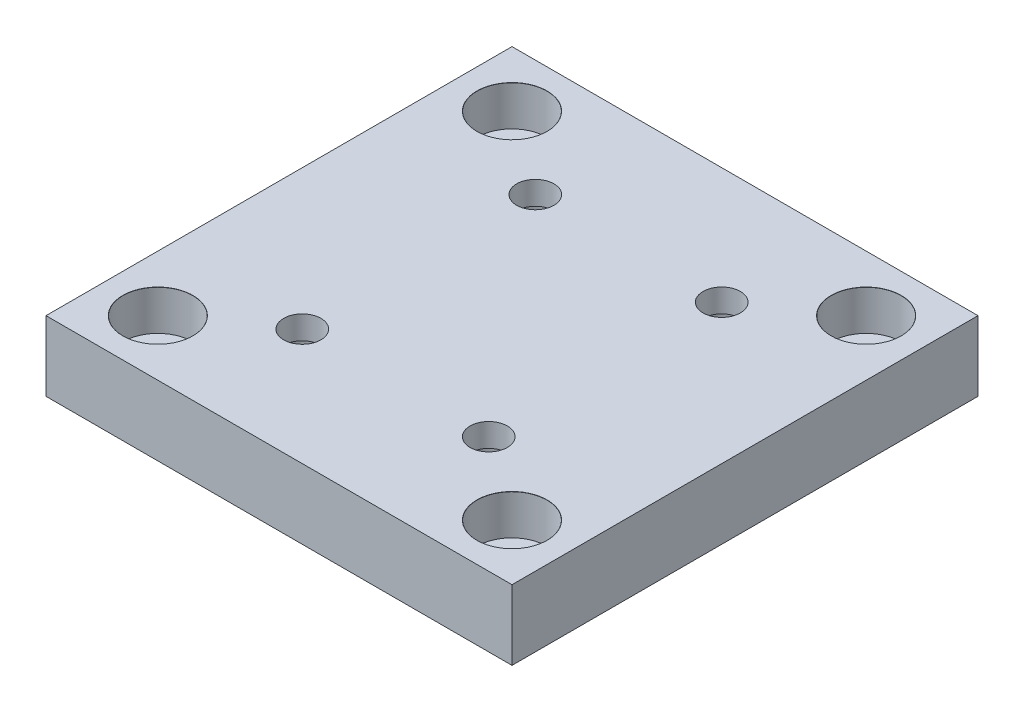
ISO-10303-21;
HEADER;
FILE_DESCRIPTION(('STEP AP214'),'2;1');
FILE_NAME('part.step','',(''),(''),'','','');
FILE_SCHEMA(('AUTOMOTIVE_DESIGN { 1 0 10303 214 1 1 1 1 }'));
ENDSEC;
DATA;
#1=APPLICATION_CONTEXT('core data for automotive mechanical design processes');
#2=APPLICATION_PROTOCOL_DEFINITION('international standard','automotive_design',2000,#1);
#3=PRODUCT_CONTEXT('',#1,'mechanical');
#4=PRODUCT('Part','Part','',(#3));
#5=PRODUCT_RELATED_PRODUCT_CATEGORY('part','',(#4));
#6=PRODUCT_DEFINITION_FORMATION('','',#4);
#7=PRODUCT_DEFINITION_CONTEXT('part definition',#1,'design');
#8=PRODUCT_DEFINITION('design','',#6,#7);
#9=PRODUCT_DEFINITION_SHAPE('','',#8);
#10=(LENGTH_UNIT() NAMED_UNIT(*) SI_UNIT(.MILLI.,.METRE.));
#11=(NAMED_UNIT(*) PLANE_ANGLE_UNIT() SI_UNIT($,.RADIAN.));
#12=(NAMED_UNIT(*) SI_UNIT($,.STERADIAN.) SOLID_ANGLE_UNIT());
#13=UNCERTAINTY_MEASURE_WITH_UNIT(LENGTH_MEASURE(1.E-05),#10,'distance_accuracy_value','');
#14=(GEOMETRIC_REPRESENTATION_CONTEXT(3) GLOBAL_UNCERTAINTY_ASSIGNED_CONTEXT((#13)) GLOBAL_UNIT_ASSIGNED_CONTEXT((#10,
#11,#12)) REPRESENTATION_CONTEXT('',''));
#15=CARTESIAN_POINT('',(0.,0.,0.));
#16=DIRECTION('',(0.,0.,1.));
#17=DIRECTION('',(1.,0.,0.));
#18=AXIS2_PLACEMENT_3D('',#15,#16,#17);
#19=CARTESIAN_POINT('',(20.,15.,25.));
#20=DIRECTION('',(0.,-1.,0.));
#21=DIRECTION('',(0.,0.,-1.));
#22=AXIS2_PLACEMENT_3D('',#19,#20,#21);
#23=CYLINDRICAL_SURFACE('',#22,4.);
#24=CARTESIAN_POINT('',(20.,15.,25.));
#25=DIRECTION('',(0.,-1.,0.));
#26=DIRECTION('',(0.,0.,-1.));
#27=AXIS2_PLACEMENT_3D('',#24,#25,#26);
#28=CIRCLE('',#27,4.);
#29=CARTESIAN_POINT('',(20.,15.,21.));
#30=VERTEX_POINT('',#29);
#31=EDGE_CURVE('E112',#30,#30,#28,.T.);
#32=ORIENTED_EDGE('',*,*,#31,.F.);
#33=EDGE_LOOP('',(#32));
#34=FACE_BOUND('',#33,.T.);
#35=CARTESIAN_POINT('',(20.,10.,25.));
#36=DIRECTION('',(0.,-1.,0.));
#37=DIRECTION('',(0.,0.,-1.));
#38=AXIS2_PLACEMENT_3D('',#35,#36,#37);
#39=CIRCLE('',#38,4.);
#40=CARTESIAN_POINT('',(20.,10.,21.));
#41=VERTEX_POINT('',#40);
#42=EDGE_CURVE('E37',#41,#41,#39,.F.);
#43=ORIENTED_EDGE('',*,*,#42,.F.);
#44=EDGE_LOOP('',(#43));
#45=FACE_BOUND('',#44,.T.);
#46=ADVANCED_FACE('F33',(#34,#45),#23,.F.);
#47=CARTESIAN_POINT('',(20.,15.,-25.));
#48=DIRECTION('',(0.,-1.,0.));
#49=DIRECTION('',(0.,0.,-1.));
#50=AXIS2_PLACEMENT_3D('',#47,#48,#49);
#51=CYLINDRICAL_SURFACE('',#50,4.);
#52=CARTESIAN_POINT('',(20.,15.,-25.));
#53=DIRECTION('',(0.,-1.,0.));
#54=DIRECTION('',(0.,0.,-1.));
#55=AXIS2_PLACEMENT_3D('',#52,#53,#54);
#56=CIRCLE('',#55,4.);
#57=CARTESIAN_POINT('',(20.,15.,-29.));
#58=VERTEX_POINT('',#57);
#59=EDGE_CURVE('E136',#58,#58,#56,.T.);
#60=ORIENTED_EDGE('',*,*,#59,.F.);
#61=EDGE_LOOP('',(#60));
#62=FACE_BOUND('',#61,.T.);
#63=CARTESIAN_POINT('',(20.,10.,-25.));
#64=DIRECTION('',(0.,-1.,0.));
#65=DIRECTION('',(0.,0.,-1.));
#66=AXIS2_PLACEMENT_3D('',#63,#64,#65);
#67=CIRCLE('',#66,4.);
#68=CARTESIAN_POINT('',(20.,10.,-29.));
#69=VERTEX_POINT('',#68);
#70=EDGE_CURVE('E116',#69,#69,#67,.F.);
#71=ORIENTED_EDGE('',*,*,#70,.F.);
#72=EDGE_LOOP('',(#71));
#73=FACE_BOUND('',#72,.T.);
#74=ADVANCED_FACE('F169',(#62,#73),#51,.F.);
#75=CARTESIAN_POINT('',(-20.,15.,-25.));
#76=DIRECTION('',(0.,-1.,0.));
#77=DIRECTION('',(0.,0.,-1.));
#78=AXIS2_PLACEMENT_3D('',#75,#76,#77);
#79=CYLINDRICAL_SURFACE('',#78,4.);
#80=CARTESIAN_POINT('',(-20.,15.,-25.));
#81=DIRECTION('',(0.,-1.,0.));
#82=DIRECTION('',(0.,0.,-1.));
#83=AXIS2_PLACEMENT_3D('',#80,#81,#82);
#84=CIRCLE('',#83,4.);
#85=CARTESIAN_POINT('',(-20.,15.,-29.));
#86=VERTEX_POINT('',#85);
#87=EDGE_CURVE('E133',#86,#86,#84,.T.);
#88=ORIENTED_EDGE('',*,*,#87,.F.);
#89=EDGE_LOOP('',(#88));
#90=FACE_BOUND('',#89,.T.);
#91=CARTESIAN_POINT('',(-20.,10.,-25.));
#92=DIRECTION('',(0.,-1.,0.));
#93=DIRECTION('',(0.,0.,-1.));
#94=AXIS2_PLACEMENT_3D('',#91,#92,#93);
#95=CIRCLE('',#94,4.);
#96=CARTESIAN_POINT('',(-20.,10.,-29.));
#97=VERTEX_POINT('',#96);
#98=EDGE_CURVE('E114',#97,#97,#95,.F.);
#99=ORIENTED_EDGE('',*,*,#98,.F.);
#100=EDGE_LOOP('',(#99));
#101=FACE_BOUND('',#100,.T.);
#102=ADVANCED_FACE('F148',(#90,#101),#79,.F.);
#103=CARTESIAN_POINT('',(-20.,15.,25.));
#104=DIRECTION('',(0.,-1.,0.));
#105=DIRECTION('',(0.,0.,-1.));
#106=AXIS2_PLACEMENT_3D('',#103,#104,#105);
#107=CYLINDRICAL_SURFACE('',#106,4.);
#108=CARTESIAN_POINT('',(-20.,15.,25.));
#109=DIRECTION('',(0.,-1.,0.));
#110=DIRECTION('',(0.,0.,-1.));
#111=AXIS2_PLACEMENT_3D('',#108,#109,#110);
#112=CIRCLE('',#111,4.);
#113=CARTESIAN_POINT('',(-20.,15.,21.));
#114=VERTEX_POINT('',#113);
#115=EDGE_CURVE('E103',#114,#114,#112,.T.);
#116=ORIENTED_EDGE('',*,*,#115,.F.);
#117=EDGE_LOOP('',(#116));
#118=FACE_BOUND('',#117,.T.);
#119=CARTESIAN_POINT('',(-20.,10.,25.));
#120=DIRECTION('',(0.,-1.,0.));
#121=DIRECTION('',(0.,0.,-1.));
#122=AXIS2_PLACEMENT_3D('',#119,#120,#121);
#123=CIRCLE('',#122,4.);
#124=CARTESIAN_POINT('',(-20.,10.,21.));
#125=VERTEX_POINT('',#124);
#126=EDGE_CURVE('E109',#125,#125,#123,.F.);
#127=ORIENTED_EDGE('',*,*,#126,.F.);
#128=EDGE_LOOP('',(#127));
#129=FACE_BOUND('',#128,.T.);
#130=ADVANCED_FACE('F145',(#118,#129),#107,.F.);
#131=CARTESIAN_POINT('',(50.,15.,50.));
#132=DIRECTION('',(-1.,0.,0.));
#133=DIRECTION('',(0.,0.,1.));
#134=AXIS2_PLACEMENT_3D('',#131,#132,#133);
#135=PLANE('',#134);
#136=DIRECTION('',(0.,0.,-1.));
#137=VECTOR('',#136,1.);
#138=CARTESIAN_POINT('',(50.,0.,50.));
#139=LINE('',#138,#137);
#140=CARTESIAN_POINT('',(50.,0.,50.));
#141=VERTEX_POINT('',#140);
#142=CARTESIAN_POINT('',(50.,0.,-50.));
#143=VERTEX_POINT('',#142);
#144=EDGE_CURVE('E100',#141,#143,#139,.T.);
#145=ORIENTED_EDGE('',*,*,#144,.T.);
#146=DIRECTION('',(0.,-1.,0.));
#147=VECTOR('',#146,1.);
#148=CARTESIAN_POINT('',(50.,15.,-50.));
#149=LINE('',#148,#147);
#150=CARTESIAN_POINT('',(50.,15.,-50.));
#151=VERTEX_POINT('',#150);
#152=EDGE_CURVE('E11',#151,#143,#149,.T.);
#153=ORIENTED_EDGE('',*,*,#152,.F.);
#154=DIRECTION('',(0.,0.,-1.));
#155=VECTOR('',#154,1.);
#156=CARTESIAN_POINT('',(50.,15.,50.));
#157=LINE('',#156,#155);
#158=CARTESIAN_POINT('',(50.,15.,50.));
#159=VERTEX_POINT('',#158);
#160=EDGE_CURVE('E87',#159,#151,#157,.T.);
#161=ORIENTED_EDGE('',*,*,#160,.F.);
#162=DIRECTION('',(0.,-1.,0.));
#163=VECTOR('',#162,1.);
#164=CARTESIAN_POINT('',(50.,15.,50.));
#165=LINE('',#164,#163);
#166=EDGE_CURVE('E96',#159,#141,#165,.T.);
#167=ORIENTED_EDGE('',*,*,#166,.T.);
#168=EDGE_LOOP('',(#145,#153,#161,#167));
#169=FACE_BOUND('',#168,.T.);
#170=ADVANCED_FACE('F35',(#169),#135,.F.);
#171=CARTESIAN_POINT('',(-50.,15.,-50.));
#172=DIRECTION('',(0.,0.,1.));
#173=DIRECTION('',(1.,0.,0.));
#174=AXIS2_PLACEMENT_3D('',#171,#172,#173);
#175=PLANE('',#174);
#176=DIRECTION('',(-1.,0.,0.));
#177=VECTOR('',#176,1.);
#178=CARTESIAN_POINT('',(-50.,0.,-50.));
#179=LINE('',#178,#177);
#180=CARTESIAN_POINT('',(-50.,0.,-50.));
#181=VERTEX_POINT('',#180);
#182=EDGE_CURVE('E91',#143,#181,#179,.T.);
#183=ORIENTED_EDGE('',*,*,#182,.T.);
#184=DIRECTION('',(0.,-1.,0.));
#185=VECTOR('',#184,1.);
#186=CARTESIAN_POINT('',(-50.,15.,-50.));
#187=LINE('',#186,#185);
#188=CARTESIAN_POINT('',(-50.,15.,-50.));
#189=VERTEX_POINT('',#188);
#190=EDGE_CURVE('E43',#189,#181,#187,.T.);
#191=ORIENTED_EDGE('',*,*,#190,.F.);
#192=DIRECTION('',(-1.,0.,0.));
#193=VECTOR('',#192,1.);
#194=CARTESIAN_POINT('',(-50.,15.,-50.));
#195=LINE('',#194,#193);
#196=EDGE_CURVE('E82',#151,#189,#195,.T.);
#197=ORIENTED_EDGE('',*,*,#196,.F.);
#198=ORIENTED_EDGE('',*,*,#152,.T.);
#199=EDGE_LOOP('',(#183,#191,#197,#198));
#200=FACE_BOUND('',#199,.T.);
#201=ADVANCED_FACE('F90',(#200),#175,.F.);
#202=CARTESIAN_POINT('',(-50.,15.,50.));
#203=DIRECTION('',(1.,0.,0.));
#204=DIRECTION('',(0.,0.,-1.));
#205=AXIS2_PLACEMENT_3D('',#202,#203,#204);
#206=PLANE('',#205);
#207=DIRECTION('',(0.,0.,1.));
#208=VECTOR('',#207,1.);
#209=CARTESIAN_POINT('',(-50.,0.,50.));
#210=LINE('',#209,#208);
#211=CARTESIAN_POINT('',(-50.,0.,50.));
#212=VERTEX_POINT('',#211);
#213=EDGE_CURVE('E69',#181,#212,#210,.T.);
#214=ORIENTED_EDGE('',*,*,#213,.T.);
#215=DIRECTION('',(0.,-1.,0.));
#216=VECTOR('',#215,1.);
#217=CARTESIAN_POINT('',(-50.,15.,50.));
#218=LINE('',#217,#216);
#219=CARTESIAN_POINT('',(-50.,15.,50.));
#220=VERTEX_POINT('',#219);
#221=EDGE_CURVE('E92',#220,#212,#218,.T.);
#222=ORIENTED_EDGE('',*,*,#221,.F.);
#223=DIRECTION('',(0.,0.,1.));
#224=VECTOR('',#223,1.);
#225=CARTESIAN_POINT('',(-50.,15.,50.));
#226=LINE('',#225,#224);
#227=EDGE_CURVE('E85',#189,#220,#226,.T.);
#228=ORIENTED_EDGE('',*,*,#227,.F.);
#229=ORIENTED_EDGE('',*,*,#190,.T.);
#230=EDGE_LOOP('',(#214,#222,#228,#229));
#231=FACE_BOUND('',#230,.T.);
#232=ADVANCED_FACE('F94',(#231),#206,.F.);
#233=CARTESIAN_POINT('',(-50.,15.,50.));
#234=DIRECTION('',(0.,0.,-1.));
#235=DIRECTION('',(-1.,0.,0.));
#236=AXIS2_PLACEMENT_3D('',#233,#234,#235);
#237=PLANE('',#236);
#238=DIRECTION('',(1.,0.,0.));
#239=VECTOR('',#238,1.);
#240=CARTESIAN_POINT('',(-50.,0.,50.));
#241=LINE('',#240,#239);
#242=EDGE_CURVE('E75',#212,#141,#241,.T.);
#243=ORIENTED_EDGE('',*,*,#242,.T.);
#244=ORIENTED_EDGE('',*,*,#166,.F.);
#245=DIRECTION('',(1.,0.,0.));
#246=VECTOR('',#245,1.);
#247=CARTESIAN_POINT('',(-50.,15.,50.));
#248=LINE('',#247,#246);
#249=EDGE_CURVE('E52',#220,#159,#248,.T.);
#250=ORIENTED_EDGE('',*,*,#249,.F.);
#251=ORIENTED_EDGE('',*,*,#221,.T.);
#252=EDGE_LOOP('',(#243,#244,#250,#251));
#253=FACE_BOUND('',#252,.T.);
#254=ADVANCED_FACE('F182',(#253),#237,.F.);
#255=CARTESIAN_POINT('',(0.,15.,0.));
#256=DIRECTION('',(0.,-1.,0.));
#257=DIRECTION('',(0.,0.,-1.));
#258=AXIS2_PLACEMENT_3D('',#255,#256,#257);
#259=PLANE('',#258);
#260=CARTESIAN_POINT('',(-38.,15.,-38.));
#261=DIRECTION('',(0.,1.,0.));
#262=DIRECTION('',(0.,0.,1.));
#263=AXIS2_PLACEMENT_3D('',#260,#261,#262);
#264=CIRCLE('',#263,7.525);
#265=CARTESIAN_POINT('',(-38.,15.,-30.475));
#266=VERTEX_POINT('',#265);
#267=EDGE_CURVE('E513',#266,#266,#264,.T.);
#268=ORIENTED_EDGE('',*,*,#267,.F.);
#269=EDGE_LOOP('',(#268));
#270=FACE_BOUND('',#269,.T.);
#271=CARTESIAN_POINT('',(-38.,15.,38.));
#272=DIRECTION('',(0.,1.,0.));
#273=DIRECTION('',(0.,0.,1.));
#274=AXIS2_PLACEMENT_3D('',#271,#272,#273);
#275=CIRCLE('',#274,7.525);
#276=CARTESIAN_POINT('',(-38.,15.,45.525));
#277=VERTEX_POINT('',#276);
#278=EDGE_CURVE('E498',#277,#277,#275,.T.);
#279=ORIENTED_EDGE('',*,*,#278,.F.);
#280=EDGE_LOOP('',(#279));
#281=FACE_BOUND('',#280,.T.);
#282=CARTESIAN_POINT('',(38.,15.,38.));
#283=DIRECTION('',(0.,1.,0.));
#284=DIRECTION('',(0.,0.,1.));
#285=AXIS2_PLACEMENT_3D('',#282,#283,#284);
#286=CIRCLE('',#285,7.525);
#287=CARTESIAN_POINT('',(38.,15.,45.525));
#288=VERTEX_POINT('',#287);
#289=EDGE_CURVE('E483',#288,#288,#286,.T.);
#290=ORIENTED_EDGE('',*,*,#289,.F.);
#291=EDGE_LOOP('',(#290));
#292=FACE_BOUND('',#291,.T.);
#293=CARTESIAN_POINT('',(38.,15.,-38.));
#294=DIRECTION('',(0.,1.,0.));
#295=DIRECTION('',(0.,0.,1.));
#296=AXIS2_PLACEMENT_3D('',#293,#294,#295);
#297=CIRCLE('',#296,7.525);
#298=CARTESIAN_POINT('',(38.,15.,-30.475));
#299=VERTEX_POINT('',#298);
#300=EDGE_CURVE('E468',#299,#299,#297,.T.);
#301=ORIENTED_EDGE('',*,*,#300,.F.);
#302=EDGE_LOOP('',(#301));
#303=FACE_BOUND('',#302,.T.);
#304=ORIENTED_EDGE('',*,*,#87,.T.);
#305=EDGE_LOOP('',(#304));
#306=FACE_BOUND('',#305,.T.);
#307=ORIENTED_EDGE('',*,*,#59,.T.);
#308=EDGE_LOOP('',(#307));
#309=FACE_BOUND('',#308,.T.);
#310=ORIENTED_EDGE('',*,*,#31,.T.);
#311=EDGE_LOOP('',(#310));
#312=FACE_BOUND('',#311,.T.);
#313=ORIENTED_EDGE('',*,*,#115,.T.);
#314=EDGE_LOOP('',(#313));
#315=FACE_BOUND('',#314,.T.);
#316=ORIENTED_EDGE('',*,*,#160,.T.);
#317=ORIENTED_EDGE('',*,*,#196,.T.);
#318=ORIENTED_EDGE('',*,*,#227,.T.);
#319=ORIENTED_EDGE('',*,*,#249,.T.);
#320=EDGE_LOOP('',(#316,#317,#318,#319));
#321=FACE_BOUND('',#320,.T.);
#322=ADVANCED_FACE('F83',(#270,#281,#292,#303,#306,#309,#312,#315,#321),#259,.F.);
#323=CARTESIAN_POINT('',(0.,0.,0.));
#324=DIRECTION('',(0.,-1.,0.));
#325=DIRECTION('',(0.,0.,-1.));
#326=AXIS2_PLACEMENT_3D('',#323,#324,#325);
#327=PLANE('',#326);
#328=CARTESIAN_POINT('',(-38.,0.,-38.));
#329=DIRECTION('',(0.,1.,0.));
#330=DIRECTION('',(0.,0.,1.));
#331=AXIS2_PLACEMENT_3D('',#328,#329,#330);
#332=CIRCLE('',#331,4.5);
#333=CARTESIAN_POINT('',(-38.,0.,-33.5));
#334=VERTEX_POINT('',#333);
#335=EDGE_CURVE('E501',#334,#334,#332,.T.);
#336=ORIENTED_EDGE('',*,*,#335,.T.);
#337=EDGE_LOOP('',(#336));
#338=FACE_BOUND('',#337,.T.);
#339=CARTESIAN_POINT('',(-38.,0.,38.));
#340=DIRECTION('',(0.,1.,0.));
#341=DIRECTION('',(0.,0.,1.));
#342=AXIS2_PLACEMENT_3D('',#339,#340,#341);
#343=CIRCLE('',#342,4.5);
#344=CARTESIAN_POINT('',(-38.,0.,42.5));
#345=VERTEX_POINT('',#344);
#346=EDGE_CURVE('E486',#345,#345,#343,.T.);
#347=ORIENTED_EDGE('',*,*,#346,.T.);
#348=EDGE_LOOP('',(#347));
#349=FACE_BOUND('',#348,.T.);
#350=CARTESIAN_POINT('',(38.,0.,38.));
#351=DIRECTION('',(0.,1.,0.));
#352=DIRECTION('',(0.,0.,1.));
#353=AXIS2_PLACEMENT_3D('',#350,#351,#352);
#354=CIRCLE('',#353,4.5);
#355=CARTESIAN_POINT('',(38.,0.,42.5));
#356=VERTEX_POINT('',#355);
#357=EDGE_CURVE('E471',#356,#356,#354,.T.);
#358=ORIENTED_EDGE('',*,*,#357,.T.);
#359=EDGE_LOOP('',(#358));
#360=FACE_BOUND('',#359,.T.);
#361=CARTESIAN_POINT('',(38.,0.,-38.));
#362=DIRECTION('',(0.,1.,0.));
#363=DIRECTION('',(0.,0.,1.));
#364=AXIS2_PLACEMENT_3D('',#361,#362,#363);
#365=CIRCLE('',#364,4.5);
#366=CARTESIAN_POINT('',(38.,0.,-33.5));
#367=VERTEX_POINT('',#366);
#368=EDGE_CURVE('E443',#367,#367,#365,.T.);
#369=ORIENTED_EDGE('',*,*,#368,.T.);
#370=EDGE_LOOP('',(#369));
#371=FACE_BOUND('',#370,.T.);
#372=CARTESIAN_POINT('',(-20.,0.,-25.));
#373=DIRECTION('',(0.,-1.,0.));
#374=DIRECTION('',(0.,0.,-1.));
#375=AXIS2_PLACEMENT_3D('',#372,#373,#374);
#376=CIRCLE('',#375,6.25);
#377=CARTESIAN_POINT('',(-20.,0.,-31.25));
#378=VERTEX_POINT('',#377);
#379=EDGE_CURVE('E455',#378,#378,#376,.T.);
#380=ORIENTED_EDGE('',*,*,#379,.F.);
#381=EDGE_LOOP('',(#380));
#382=FACE_BOUND('',#381,.T.);
#383=CARTESIAN_POINT('',(20.,0.,-25.));
#384=DIRECTION('',(0.,-1.,0.));
#385=DIRECTION('',(0.,0.,-1.));
#386=AXIS2_PLACEMENT_3D('',#383,#384,#385);
#387=CIRCLE('',#386,6.25);
#388=CARTESIAN_POINT('',(20.,0.,-31.25));
#389=VERTEX_POINT('',#388);
#390=EDGE_CURVE('E444',#389,#389,#387,.T.);
#391=ORIENTED_EDGE('',*,*,#390,.F.);
#392=EDGE_LOOP('',(#391));
#393=FACE_BOUND('',#392,.T.);
#394=CARTESIAN_POINT('',(20.,0.,25.));
#395=DIRECTION('',(0.,-1.,0.));
#396=DIRECTION('',(0.,0.,-1.));
#397=AXIS2_PLACEMENT_3D('',#394,#395,#396);
#398=CIRCLE('',#397,6.25);
#399=CARTESIAN_POINT('',(20.,0.,18.75));
#400=VERTEX_POINT('',#399);
#401=EDGE_CURVE('E441',#400,#400,#398,.T.);
#402=ORIENTED_EDGE('',*,*,#401,.F.);
#403=EDGE_LOOP('',(#402));
#404=FACE_BOUND('',#403,.T.);
#405=CARTESIAN_POINT('',(-20.,0.,25.));
#406=DIRECTION('',(0.,-1.,0.));
#407=DIRECTION('',(0.,0.,-1.));
#408=AXIS2_PLACEMENT_3D('',#405,#406,#407);
#409=CIRCLE('',#408,6.25);
#410=CARTESIAN_POINT('',(-20.,0.,18.75));
#411=VERTEX_POINT('',#410);
#412=EDGE_CURVE('E122',#411,#411,#409,.T.);
#413=ORIENTED_EDGE('',*,*,#412,.F.);
#414=EDGE_LOOP('',(#413));
#415=FACE_BOUND('',#414,.T.);
#416=ORIENTED_EDGE('',*,*,#144,.F.);
#417=ORIENTED_EDGE('',*,*,#242,.F.);
#418=ORIENTED_EDGE('',*,*,#213,.F.);
#419=ORIENTED_EDGE('',*,*,#182,.F.);
#420=EDGE_LOOP('',(#416,#417,#418,#419));
#421=FACE_BOUND('',#420,.T.);
#422=ADVANCED_FACE('F155',(#338,#349,#360,#371,#382,#393,#404,#415,#421),#327,.T.);
#423=CARTESIAN_POINT('',(-20.,10.,25.));
#424=DIRECTION('',(0.,-1.,0.));
#425=DIRECTION('',(0.,0.,-1.));
#426=AXIS2_PLACEMENT_3D('',#423,#424,#425);
#427=PLANE('',#426);
#428=CARTESIAN_POINT('',(-20.,10.,25.));
#429=DIRECTION('',(0.,-1.,0.));
#430=DIRECTION('',(0.,0.,-1.));
#431=AXIS2_PLACEMENT_3D('',#428,#429,#430);
#432=CIRCLE('',#431,6.25);
#433=CARTESIAN_POINT('',(-20.,10.,18.75));
#434=VERTEX_POINT('',#433);
#435=EDGE_CURVE('E113',#434,#434,#432,.T.);
#436=ORIENTED_EDGE('',*,*,#435,.T.);
#437=EDGE_LOOP('',(#436));
#438=FACE_BOUND('',#437,.T.);
#439=ORIENTED_EDGE('',*,*,#126,.T.);
#440=EDGE_LOOP('',(#439));
#441=FACE_BOUND('',#440,.T.);
#442=ADVANCED_FACE('F152',(#438,#441),#427,.T.);
#443=CARTESIAN_POINT('',(-20.,10.,25.));
#444=DIRECTION('',(0.,-1.,0.));
#445=DIRECTION('',(0.,0.,-1.));
#446=AXIS2_PLACEMENT_3D('',#443,#444,#445);
#447=CYLINDRICAL_SURFACE('',#446,6.25);
#448=ORIENTED_EDGE('',*,*,#435,.F.);
#449=EDGE_LOOP('',(#448));
#450=FACE_BOUND('',#449,.T.);
#451=ORIENTED_EDGE('',*,*,#412,.T.);
#452=EDGE_LOOP('',(#451));
#453=FACE_BOUND('',#452,.T.);
#454=ADVANCED_FACE('F154',(#450,#453),#447,.F.);
#455=CARTESIAN_POINT('',(-20.,10.,-25.));
#456=DIRECTION('',(0.,-1.,0.));
#457=DIRECTION('',(0.,0.,-1.));
#458=AXIS2_PLACEMENT_3D('',#455,#456,#457);
#459=PLANE('',#458);
#460=CARTESIAN_POINT('',(-20.,10.,-25.));
#461=DIRECTION('',(0.,-1.,0.));
#462=DIRECTION('',(0.,0.,-1.));
#463=AXIS2_PLACEMENT_3D('',#460,#461,#462);
#464=CIRCLE('',#463,6.25);
#465=CARTESIAN_POINT('',(-20.,10.,-31.25));
#466=VERTEX_POINT('',#465);
#467=EDGE_CURVE('E117',#466,#466,#464,.T.);
#468=ORIENTED_EDGE('',*,*,#467,.T.);
#469=EDGE_LOOP('',(#468));
#470=FACE_BOUND('',#469,.T.);
#471=ORIENTED_EDGE('',*,*,#98,.T.);
#472=EDGE_LOOP('',(#471));
#473=FACE_BOUND('',#472,.T.);
#474=ADVANCED_FACE('F162',(#470,#473),#459,.T.);
#475=CARTESIAN_POINT('',(-20.,10.,-25.));
#476=DIRECTION('',(0.,-1.,0.));
#477=DIRECTION('',(0.,0.,-1.));
#478=AXIS2_PLACEMENT_3D('',#475,#476,#477);
#479=CYLINDRICAL_SURFACE('',#478,6.25);
#480=ORIENTED_EDGE('',*,*,#467,.F.);
#481=EDGE_LOOP('',(#480));
#482=FACE_BOUND('',#481,.T.);
#483=ORIENTED_EDGE('',*,*,#379,.T.);
#484=EDGE_LOOP('',(#483));
#485=FACE_BOUND('',#484,.T.);
#486=ADVANCED_FACE('F417',(#482,#485),#479,.F.);
#487=CARTESIAN_POINT('',(20.,10.,-25.));
#488=DIRECTION('',(0.,-1.,0.));
#489=DIRECTION('',(0.,0.,-1.));
#490=AXIS2_PLACEMENT_3D('',#487,#488,#489);
#491=PLANE('',#490);
#492=CARTESIAN_POINT('',(20.,10.,-25.));
#493=DIRECTION('',(0.,-1.,0.));
#494=DIRECTION('',(0.,0.,-1.));
#495=AXIS2_PLACEMENT_3D('',#492,#493,#494);
#496=CIRCLE('',#495,6.25);
#497=CARTESIAN_POINT('',(20.,10.,-31.25));
#498=VERTEX_POINT('',#497);
#499=EDGE_CURVE('E452',#498,#498,#496,.T.);
#500=ORIENTED_EDGE('',*,*,#499,.T.);
#501=EDGE_LOOP('',(#500));
#502=FACE_BOUND('',#501,.T.);
#503=ORIENTED_EDGE('',*,*,#70,.T.);
#504=EDGE_LOOP('',(#503));
#505=FACE_BOUND('',#504,.T.);
#506=ADVANCED_FACE('F421',(#502,#505),#491,.T.);
#507=CARTESIAN_POINT('',(20.,10.,-25.));
#508=DIRECTION('',(0.,-1.,0.));
#509=DIRECTION('',(0.,0.,-1.));
#510=AXIS2_PLACEMENT_3D('',#507,#508,#509);
#511=CYLINDRICAL_SURFACE('',#510,6.25);
#512=ORIENTED_EDGE('',*,*,#499,.F.);
#513=EDGE_LOOP('',(#512));
#514=FACE_BOUND('',#513,.T.);
#515=ORIENTED_EDGE('',*,*,#390,.T.);
#516=EDGE_LOOP('',(#515));
#517=FACE_BOUND('',#516,.T.);
#518=ADVANCED_FACE('F425',(#514,#517),#511,.F.);
#519=CARTESIAN_POINT('',(20.,10.,25.));
#520=DIRECTION('',(0.,-1.,0.));
#521=DIRECTION('',(0.,0.,-1.));
#522=AXIS2_PLACEMENT_3D('',#519,#520,#521);
#523=PLANE('',#522);
#524=CARTESIAN_POINT('',(20.,10.,25.));
#525=DIRECTION('',(0.,-1.,0.));
#526=DIRECTION('',(0.,0.,-1.));
#527=AXIS2_PLACEMENT_3D('',#524,#525,#526);
#528=CIRCLE('',#527,6.25);
#529=CARTESIAN_POINT('',(20.,10.,18.75));
#530=VERTEX_POINT('',#529);
#531=EDGE_CURVE('E438',#530,#530,#528,.T.);
#532=ORIENTED_EDGE('',*,*,#531,.T.);
#533=EDGE_LOOP('',(#532));
#534=FACE_BOUND('',#533,.T.);
#535=ORIENTED_EDGE('',*,*,#42,.T.);
#536=EDGE_LOOP('',(#535));
#537=FACE_BOUND('',#536,.T.);
#538=ADVANCED_FACE('F429',(#534,#537),#523,.T.);
#539=CARTESIAN_POINT('',(20.,10.,25.));
#540=DIRECTION('',(0.,-1.,0.));
#541=DIRECTION('',(0.,0.,-1.));
#542=AXIS2_PLACEMENT_3D('',#539,#540,#541);
#543=CYLINDRICAL_SURFACE('',#542,6.25);
#544=ORIENTED_EDGE('',*,*,#531,.F.);
#545=EDGE_LOOP('',(#544));
#546=FACE_BOUND('',#545,.T.);
#547=ORIENTED_EDGE('',*,*,#401,.T.);
#548=EDGE_LOOP('',(#547));
#549=FACE_BOUND('',#548,.T.);
#550=ADVANCED_FACE('F256',(#546,#549),#543,.F.);
#551=CARTESIAN_POINT('',(38.,15.,-38.));
#552=DIRECTION('',(0.,1.,0.));
#553=DIRECTION('',(0.,0.,1.));
#554=AXIS2_PLACEMENT_3D('',#551,#552,#553);
#555=CYLINDRICAL_SURFACE('',#554,4.5);
#556=ORIENTED_EDGE('',*,*,#368,.F.);
#557=EDGE_LOOP('',(#556));
#558=FACE_BOUND('',#557,.T.);
#559=CARTESIAN_POINT('',(38.,6.4,-38.));
#560=DIRECTION('',(0.,1.,0.));
#561=DIRECTION('',(0.,0.,1.));
#562=AXIS2_PLACEMENT_3D('',#559,#560,#561);
#563=CIRCLE('',#562,4.5);
#564=CARTESIAN_POINT('',(38.,6.4,-33.5));
#565=VERTEX_POINT('',#564);
#566=EDGE_CURVE('E447',#565,#565,#563,.T.);
#567=ORIENTED_EDGE('',*,*,#566,.T.);
#568=EDGE_LOOP('',(#567));
#569=FACE_BOUND('',#568,.T.);
#570=ADVANCED_FACE('F250',(#558,#569),#555,.F.);
#571=CARTESIAN_POINT('',(45.5,6.4,-38.));
#572=DIRECTION('',(0.,-1.,0.));
#573=DIRECTION('',(0.,0.,-1.));
#574=AXIS2_PLACEMENT_3D('',#571,#572,#573);
#575=PLANE('',#574);
#576=ORIENTED_EDGE('',*,*,#566,.F.);
#577=EDGE_LOOP('',(#576));
#578=FACE_BOUND('',#577,.T.);
#579=CARTESIAN_POINT('',(38.,6.4,-38.));
#580=DIRECTION('',(0.,1.,0.));
#581=DIRECTION('',(0.,0.,1.));
#582=AXIS2_PLACEMENT_3D('',#579,#580,#581);
#583=CIRCLE('',#582,7.5);
#584=CARTESIAN_POINT('',(38.,6.4,-30.5));
#585=VERTEX_POINT('',#584);
#586=EDGE_CURVE('E462',#585,#585,#583,.T.);
#587=ORIENTED_EDGE('',*,*,#586,.T.);
#588=EDGE_LOOP('',(#587));
#589=FACE_BOUND('',#588,.T.);
#590=ADVANCED_FACE('F255',(#578,#589),#575,.F.);
#591=CARTESIAN_POINT('',(38.,15.,-38.));
#592=DIRECTION('',(0.,1.,0.));
#593=DIRECTION('',(0.,0.,1.));
#594=AXIS2_PLACEMENT_3D('',#591,#592,#593);
#595=CYLINDRICAL_SURFACE('',#594,7.5);
#596=ORIENTED_EDGE('',*,*,#586,.F.);
#597=EDGE_LOOP('',(#596));
#598=FACE_BOUND('',#597,.T.);
#599=CARTESIAN_POINT('',(38.,14.975,-38.));
#600=DIRECTION('',(0.,1.,0.));
#601=DIRECTION('',(0.,0.,1.));
#602=AXIS2_PLACEMENT_3D('',#599,#600,#601);
#603=CIRCLE('',#602,7.5);
#604=CARTESIAN_POINT('',(38.,14.975,-30.5));
#605=VERTEX_POINT('',#604);
#606=EDGE_CURVE('E465',#605,#605,#603,.T.);
#607=ORIENTED_EDGE('',*,*,#606,.T.);
#608=EDGE_LOOP('',(#607));
#609=FACE_BOUND('',#608,.T.);
#610=ADVANCED_FACE('F268',(#598,#609),#595,.F.);
#611=CARTESIAN_POINT('',(38.,15.,-38.));
#612=DIRECTION('',(0.,1.,0.));
#613=DIRECTION('',(0.,0.,1.));
#614=AXIS2_PLACEMENT_3D('',#611,#612,#613);
#615=CONICAL_SURFACE('',#614,7.525,0.785398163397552);
#616=ORIENTED_EDGE('',*,*,#606,.F.);
#617=EDGE_LOOP('',(#616));
#618=FACE_BOUND('',#617,.T.);
#619=ORIENTED_EDGE('',*,*,#300,.T.);
#620=EDGE_LOOP('',(#619));
#621=FACE_BOUND('',#620,.T.);
#622=ADVANCED_FACE('F278',(#618,#621),#615,.F.);
#623=CARTESIAN_POINT('',(38.,15.,38.));
#624=DIRECTION('',(0.,1.,0.));
#625=DIRECTION('',(0.,0.,1.));
#626=AXIS2_PLACEMENT_3D('',#623,#624,#625);
#627=CYLINDRICAL_SURFACE('',#626,4.5);
#628=ORIENTED_EDGE('',*,*,#357,.F.);
#629=EDGE_LOOP('',(#628));
#630=FACE_BOUND('',#629,.T.);
#631=CARTESIAN_POINT('',(38.,6.4,38.));
#632=DIRECTION('',(0.,1.,0.));
#633=DIRECTION('',(0.,0.,1.));
#634=AXIS2_PLACEMENT_3D('',#631,#632,#633);
#635=CIRCLE('',#634,4.5);
#636=CARTESIAN_POINT('',(38.,6.4,42.5));
#637=VERTEX_POINT('',#636);
#638=EDGE_CURVE('E474',#637,#637,#635,.T.);
#639=ORIENTED_EDGE('',*,*,#638,.T.);
#640=EDGE_LOOP('',(#639));
#641=FACE_BOUND('',#640,.T.);
#642=ADVANCED_FACE('F288',(#630,#641),#627,.F.);
#643=CARTESIAN_POINT('',(45.5,6.4,38.));
#644=DIRECTION('',(0.,-1.,0.));
#645=DIRECTION('',(0.,0.,-1.));
#646=AXIS2_PLACEMENT_3D('',#643,#644,#645);
#647=PLANE('',#646);
#648=ORIENTED_EDGE('',*,*,#638,.F.);
#649=EDGE_LOOP('',(#648));
#650=FACE_BOUND('',#649,.T.);
#651=CARTESIAN_POINT('',(38.,6.4,38.));
#652=DIRECTION('',(0.,1.,0.));
#653=DIRECTION('',(0.,0.,1.));
#654=AXIS2_PLACEMENT_3D('',#651,#652,#653);
#655=CIRCLE('',#654,7.5);
#656=CARTESIAN_POINT('',(38.,6.4,45.5));
#657=VERTEX_POINT('',#656);
#658=EDGE_CURVE('E477',#657,#657,#655,.T.);
#659=ORIENTED_EDGE('',*,*,#658,.T.);
#660=EDGE_LOOP('',(#659));
#661=FACE_BOUND('',#660,.T.);
#662=ADVANCED_FACE('F298',(#650,#661),#647,.F.);
#663=CARTESIAN_POINT('',(38.,15.,38.));
#664=DIRECTION('',(0.,1.,0.));
#665=DIRECTION('',(0.,0.,1.));
#666=AXIS2_PLACEMENT_3D('',#663,#664,#665);
#667=CYLINDRICAL_SURFACE('',#666,7.5);
#668=ORIENTED_EDGE('',*,*,#658,.F.);
#669=EDGE_LOOP('',(#668));
#670=FACE_BOUND('',#669,.T.);
#671=CARTESIAN_POINT('',(38.,14.975,38.));
#672=DIRECTION('',(0.,1.,0.));
#673=DIRECTION('',(0.,0.,1.));
#674=AXIS2_PLACEMENT_3D('',#671,#672,#673);
#675=CIRCLE('',#674,7.5);
#676=CARTESIAN_POINT('',(38.,14.975,45.5));
#677=VERTEX_POINT('',#676);
#678=EDGE_CURVE('E480',#677,#677,#675,.T.);
#679=ORIENTED_EDGE('',*,*,#678,.T.);
#680=EDGE_LOOP('',(#679));
#681=FACE_BOUND('',#680,.T.);
#682=ADVANCED_FACE('F308',(#670,#681),#667,.F.);
#683=CARTESIAN_POINT('',(38.,15.,38.));
#684=DIRECTION('',(0.,1.,0.));
#685=DIRECTION('',(0.,0.,1.));
#686=AXIS2_PLACEMENT_3D('',#683,#684,#685);
#687=CONICAL_SURFACE('',#686,7.525,0.785398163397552);
#688=ORIENTED_EDGE('',*,*,#678,.F.);
#689=EDGE_LOOP('',(#688));
#690=FACE_BOUND('',#689,.T.);
#691=ORIENTED_EDGE('',*,*,#289,.T.);
#692=EDGE_LOOP('',(#691));
#693=FACE_BOUND('',#692,.T.);
#694=ADVANCED_FACE('F318',(#690,#693),#687,.F.);
#695=CARTESIAN_POINT('',(-38.,15.,38.));
#696=DIRECTION('',(0.,1.,0.));
#697=DIRECTION('',(0.,0.,1.));
#698=AXIS2_PLACEMENT_3D('',#695,#696,#697);
#699=CYLINDRICAL_SURFACE('',#698,4.5);
#700=ORIENTED_EDGE('',*,*,#346,.F.);
#701=EDGE_LOOP('',(#700));
#702=FACE_BOUND('',#701,.T.);
#703=CARTESIAN_POINT('',(-38.,6.4,38.));
#704=DIRECTION('',(0.,1.,0.));
#705=DIRECTION('',(0.,0.,1.));
#706=AXIS2_PLACEMENT_3D('',#703,#704,#705);
#707=CIRCLE('',#706,4.5);
#708=CARTESIAN_POINT('',(-38.,6.4,42.5));
#709=VERTEX_POINT('',#708);
#710=EDGE_CURVE('E489',#709,#709,#707,.T.);
#711=ORIENTED_EDGE('',*,*,#710,.T.);
#712=EDGE_LOOP('',(#711));
#713=FACE_BOUND('',#712,.T.);
#714=ADVANCED_FACE('F328',(#702,#713),#699,.F.);
#715=CARTESIAN_POINT('',(-30.5,6.4,38.));
#716=DIRECTION('',(0.,-1.,0.));
#717=DIRECTION('',(0.,0.,-1.));
#718=AXIS2_PLACEMENT_3D('',#715,#716,#717);
#719=PLANE('',#718);
#720=ORIENTED_EDGE('',*,*,#710,.F.);
#721=EDGE_LOOP('',(#720));
#722=FACE_BOUND('',#721,.T.);
#723=CARTESIAN_POINT('',(-38.,6.4,38.));
#724=DIRECTION('',(0.,1.,0.));
#725=DIRECTION('',(0.,0.,1.));
#726=AXIS2_PLACEMENT_3D('',#723,#724,#725);
#727=CIRCLE('',#726,7.5);
#728=CARTESIAN_POINT('',(-38.,6.4,45.5));
#729=VERTEX_POINT('',#728);
#730=EDGE_CURVE('E492',#729,#729,#727,.T.);
#731=ORIENTED_EDGE('',*,*,#730,.T.);
#732=EDGE_LOOP('',(#731));
#733=FACE_BOUND('',#732,.T.);
#734=ADVANCED_FACE('F338',(#722,#733),#719,.F.);
#735=CARTESIAN_POINT('',(-38.,15.,38.));
#736=DIRECTION('',(0.,1.,0.));
#737=DIRECTION('',(0.,0.,1.));
#738=AXIS2_PLACEMENT_3D('',#735,#736,#737);
#739=CYLINDRICAL_SURFACE('',#738,7.5);
#740=ORIENTED_EDGE('',*,*,#730,.F.);
#741=EDGE_LOOP('',(#740));
#742=FACE_BOUND('',#741,.T.);
#743=CARTESIAN_POINT('',(-38.,14.975,38.));
#744=DIRECTION('',(0.,1.,0.));
#745=DIRECTION('',(0.,0.,1.));
#746=AXIS2_PLACEMENT_3D('',#743,#744,#745);
#747=CIRCLE('',#746,7.5);
#748=CARTESIAN_POINT('',(-38.,14.975,45.5));
#749=VERTEX_POINT('',#748);
#750=EDGE_CURVE('E495',#749,#749,#747,.T.);
#751=ORIENTED_EDGE('',*,*,#750,.T.);
#752=EDGE_LOOP('',(#751));
#753=FACE_BOUND('',#752,.T.);
#754=ADVANCED_FACE('F348',(#742,#753),#739,.F.);
#755=CARTESIAN_POINT('',(-38.,15.,38.));
#756=DIRECTION('',(0.,1.,0.));
#757=DIRECTION('',(0.,0.,1.));
#758=AXIS2_PLACEMENT_3D('',#755,#756,#757);
#759=CONICAL_SURFACE('',#758,7.525,0.785398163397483);
#760=ORIENTED_EDGE('',*,*,#750,.F.);
#761=EDGE_LOOP('',(#760));
#762=FACE_BOUND('',#761,.T.);
#763=ORIENTED_EDGE('',*,*,#278,.T.);
#764=EDGE_LOOP('',(#763));
#765=FACE_BOUND('',#764,.T.);
#766=ADVANCED_FACE('F358',(#762,#765),#759,.F.);
#767=CARTESIAN_POINT('',(-38.,15.,-38.));
#768=DIRECTION('',(0.,1.,0.));
#769=DIRECTION('',(0.,0.,1.));
#770=AXIS2_PLACEMENT_3D('',#767,#768,#769);
#771=CYLINDRICAL_SURFACE('',#770,4.5);
#772=ORIENTED_EDGE('',*,*,#335,.F.);
#773=EDGE_LOOP('',(#772));
#774=FACE_BOUND('',#773,.T.);
#775=CARTESIAN_POINT('',(-38.,6.4,-38.));
#776=DIRECTION('',(0.,1.,0.));
#777=DIRECTION('',(0.,0.,1.));
#778=AXIS2_PLACEMENT_3D('',#775,#776,#777);
#779=CIRCLE('',#778,4.5);
#780=CARTESIAN_POINT('',(-38.,6.4,-33.5));
#781=VERTEX_POINT('',#780);
#782=EDGE_CURVE('E504',#781,#781,#779,.T.);
#783=ORIENTED_EDGE('',*,*,#782,.T.);
#784=EDGE_LOOP('',(#783));
#785=FACE_BOUND('',#784,.T.);
#786=ADVANCED_FACE('F368',(#774,#785),#771,.F.);
#787=CARTESIAN_POINT('',(-30.5,6.4,-38.));
#788=DIRECTION('',(0.,-1.,0.));
#789=DIRECTION('',(0.,0.,-1.));
#790=AXIS2_PLACEMENT_3D('',#787,#788,#789);
#791=PLANE('',#790);
#792=ORIENTED_EDGE('',*,*,#782,.F.);
#793=EDGE_LOOP('',(#792));
#794=FACE_BOUND('',#793,.T.);
#795=CARTESIAN_POINT('',(-38.,6.4,-38.));
#796=DIRECTION('',(0.,1.,0.));
#797=DIRECTION('',(0.,0.,1.));
#798=AXIS2_PLACEMENT_3D('',#795,#796,#797);
#799=CIRCLE('',#798,7.5);
#800=CARTESIAN_POINT('',(-38.,6.4,-30.5));
#801=VERTEX_POINT('',#800);
#802=EDGE_CURVE('E507',#801,#801,#799,.T.);
#803=ORIENTED_EDGE('',*,*,#802,.T.);
#804=EDGE_LOOP('',(#803));
#805=FACE_BOUND('',#804,.T.);
#806=ADVANCED_FACE('F378',(#794,#805),#791,.F.);
#807=CARTESIAN_POINT('',(-38.,15.,-38.));
#808=DIRECTION('',(0.,1.,0.));
#809=DIRECTION('',(0.,0.,1.));
#810=AXIS2_PLACEMENT_3D('',#807,#808,#809);
#811=CYLINDRICAL_SURFACE('',#810,7.5);
#812=ORIENTED_EDGE('',*,*,#802,.F.);
#813=EDGE_LOOP('',(#812));
#814=FACE_BOUND('',#813,.T.);
#815=CARTESIAN_POINT('',(-38.,14.975,-38.));
#816=DIRECTION('',(0.,1.,0.));
#817=DIRECTION('',(0.,0.,1.));
#818=AXIS2_PLACEMENT_3D('',#815,#816,#817);
#819=CIRCLE('',#818,7.5);
#820=CARTESIAN_POINT('',(-38.,14.975,-30.5));
#821=VERTEX_POINT('',#820);
#822=EDGE_CURVE('E510',#821,#821,#819,.T.);
#823=ORIENTED_EDGE('',*,*,#822,.T.);
#824=EDGE_LOOP('',(#823));
#825=FACE_BOUND('',#824,.T.);
#826=ADVANCED_FACE('F388',(#814,#825),#811,.F.);
#827=CARTESIAN_POINT('',(-38.,15.,-38.));
#828=DIRECTION('',(0.,1.,0.));
#829=DIRECTION('',(0.,0.,1.));
#830=AXIS2_PLACEMENT_3D('',#827,#828,#829);
#831=CONICAL_SURFACE('',#830,7.525,0.785398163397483);
#832=ORIENTED_EDGE('',*,*,#822,.F.);
#833=EDGE_LOOP('',(#832));
#834=FACE_BOUND('',#833,.T.);
#835=ORIENTED_EDGE('',*,*,#267,.T.);
#836=EDGE_LOOP('',(#835));
#837=FACE_BOUND('',#836,.T.);
#838=ADVANCED_FACE('F398',(#834,#837),#831,.F.);
#839=CLOSED_SHELL('',(#46,#74,#102,#130,#170,#201,#232,#254,#322,#422,#442,#454,#474,#486,#506,
#518,#538,#550,#570,#590,#610,#622,#642,#662,#682,#694,#714,#734,#754,#766,#786,#806,#826,#838));
#840=MANIFOLD_SOLID_BREP('B2',#839);
#841=ADVANCED_BREP_SHAPE_REPRESENTATION('',(#18,#840),#14);
#842=SHAPE_DEFINITION_REPRESENTATION(#9,#841);
ENDSEC;
END-ISO-10303-21;
